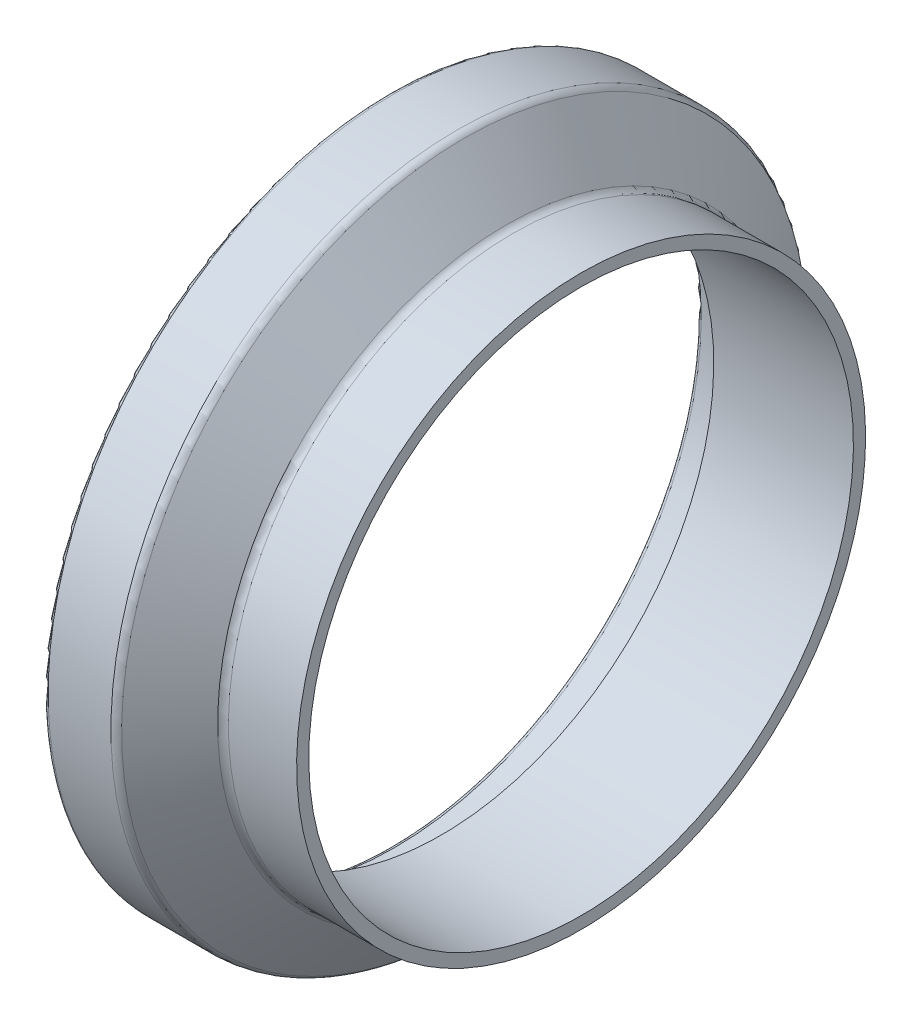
ISO-10303-21;
HEADER;
FILE_DESCRIPTION(('STEP AP214'),'2;1');
FILE_NAME('part.step','',(''),(''),'','','');
FILE_SCHEMA(('AUTOMOTIVE_DESIGN { 1 0 10303 214 1 1 1 1 }'));
ENDSEC;
DATA;
#1=APPLICATION_CONTEXT('core data for automotive mechanical design processes');
#2=APPLICATION_PROTOCOL_DEFINITION('international standard','automotive_design',2000,#1);
#3=PRODUCT_CONTEXT('',#1,'mechanical');
#4=PRODUCT('Part','Part','',(#3));
#5=PRODUCT_RELATED_PRODUCT_CATEGORY('part','',(#4));
#6=PRODUCT_DEFINITION_FORMATION('','',#4);
#7=PRODUCT_DEFINITION_CONTEXT('part definition',#1,'design');
#8=PRODUCT_DEFINITION('design','',#6,#7);
#9=PRODUCT_DEFINITION_SHAPE('','',#8);
#10=(LENGTH_UNIT() NAMED_UNIT(*) SI_UNIT(.MILLI.,.METRE.));
#11=(NAMED_UNIT(*) PLANE_ANGLE_UNIT() SI_UNIT($,.RADIAN.));
#12=(NAMED_UNIT(*) SI_UNIT($,.STERADIAN.) SOLID_ANGLE_UNIT());
#13=UNCERTAINTY_MEASURE_WITH_UNIT(LENGTH_MEASURE(1.E-05),#10,'distance_accuracy_value','');
#14=(GEOMETRIC_REPRESENTATION_CONTEXT(3) GLOBAL_UNCERTAINTY_ASSIGNED_CONTEXT((#13)) GLOBAL_UNIT_ASSIGNED_CONTEXT((#10,
#11,#12)) REPRESENTATION_CONTEXT('',''));
#15=CARTESIAN_POINT('',(0.,0.,0.));
#16=DIRECTION('',(0.,0.,1.));
#17=DIRECTION('',(1.,0.,0.));
#18=AXIS2_PLACEMENT_3D('',#15,#16,#17);
#19=CARTESIAN_POINT('',(-1.65198352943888,50.8,0.));
#20=DIRECTION('',(1.,0.,0.));
#21=DIRECTION('',(0.,0.999999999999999,0.));
#22=AXIS2_PLACEMENT_3D('',#19,#20,#21);
#23=PLANE('',#22);
#24=CARTESIAN_POINT('',(-1.65198352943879,0.,0.));
#25=DIRECTION('',(1.,0.,0.));
#26=DIRECTION('',(0.,0.999999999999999,0.));
#27=AXIS2_PLACEMENT_3D('',#24,#25,#26);
#28=CIRCLE('',#27,50.8);
#29=CARTESIAN_POINT('',(-1.65198352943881,50.7999999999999,0.));
#30=VERTEX_POINT('',#29);
#31=EDGE_CURVE('E86',#30,#30,#28,.T.);
#32=ORIENTED_EDGE('',*,*,#31,.T.);
#33=EDGE_LOOP('',(#32));
#34=FACE_BOUND('',#33,.T.);
#35=CARTESIAN_POINT('',(-1.65198352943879,0.,0.));
#36=DIRECTION('',(1.,0.,0.));
#37=DIRECTION('',(0.,0.999999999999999,0.));
#38=AXIS2_PLACEMENT_3D('',#35,#36,#37);
#39=CIRCLE('',#38,48.6283);
#40=CARTESIAN_POINT('',(-1.65198352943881,48.6283,0.));
#41=VERTEX_POINT('',#40);
#42=EDGE_CURVE('E12',#41,#41,#39,.T.);
#43=ORIENTED_EDGE('',*,*,#42,.F.);
#44=EDGE_LOOP('',(#43));
#45=FACE_BOUND('',#44,.T.);
#46=ADVANCED_FACE('F43',(#34,#45),#23,.T.);
#47=CARTESIAN_POINT('',(0.,0.,0.));
#48=DIRECTION('',(1.,0.,0.));
#49=DIRECTION('',(0.,0.999999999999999,0.));
#50=AXIS2_PLACEMENT_3D('',#47,#48,#49);
#51=CYLINDRICAL_SURFACE('',#50,48.6283);
#52=ORIENTED_EDGE('',*,*,#42,.T.);
#53=EDGE_LOOP('',(#52));
#54=FACE_BOUND('',#53,.T.);
#55=CARTESIAN_POINT('',(-26.5947835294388,0.,0.));
#56=DIRECTION('',(1.,0.,0.));
#57=DIRECTION('',(0.,0.999999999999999,0.));
#58=AXIS2_PLACEMENT_3D('',#55,#56,#57);
#59=CIRCLE('',#58,48.6283);
#60=CARTESIAN_POINT('',(-26.5947835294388,48.6283,0.));
#61=VERTEX_POINT('',#60);
#62=EDGE_CURVE('E49',#61,#61,#59,.T.);
#63=ORIENTED_EDGE('',*,*,#62,.F.);
#64=EDGE_LOOP('',(#63));
#65=FACE_BOUND('',#64,.T.);
#66=ADVANCED_FACE('F104',(#54,#65),#51,.F.);
#67=CARTESIAN_POINT('',(-26.5947835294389,48.6283,0.));
#68=DIRECTION('',(-1.,0.,0.));
#69=DIRECTION('',(0.,-0.999999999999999,0.));
#70=AXIS2_PLACEMENT_3D('',#67,#68,#69);
#71=PLANE('',#70);
#72=ORIENTED_EDGE('',*,*,#62,.T.);
#73=EDGE_LOOP('',(#72));
#74=FACE_BOUND('',#73,.T.);
#75=CARTESIAN_POINT('',(-26.5947835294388,0.,0.));
#76=DIRECTION('',(1.,0.,0.));
#77=DIRECTION('',(0.,0.999999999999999,0.));
#78=AXIS2_PLACEMENT_3D('',#75,#76,#77);
#79=CIRCLE('',#78,53.9623);
#80=CARTESIAN_POINT('',(-26.5947835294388,53.9622999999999,0.));
#81=VERTEX_POINT('',#80);
#82=EDGE_CURVE('E53',#81,#81,#79,.T.);
#83=ORIENTED_EDGE('',*,*,#82,.F.);
#84=EDGE_LOOP('',(#83));
#85=FACE_BOUND('',#84,.T.);
#86=ADVANCED_FACE('F108',(#74,#85),#71,.T.);
#87=CARTESIAN_POINT('',(-27.4075835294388,0.,0.));
#88=DIRECTION('',(1.,0.,0.));
#89=DIRECTION('',(0.,0.999999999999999,0.));
#90=AXIS2_PLACEMENT_3D('',#87,#88,#89);
#91=TOROIDAL_SURFACE('',#90,53.9623,0.812800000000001);
#92=ORIENTED_EDGE('',*,*,#82,.T.);
#93=EDGE_LOOP('',(#92));
#94=FACE_BOUND('',#93,.T.);
#95=CARTESIAN_POINT('',(-27.4075835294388,0.,0.));
#96=DIRECTION('',(1.,0.,0.));
#97=DIRECTION('',(0.,0.999999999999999,0.));
#98=AXIS2_PLACEMENT_3D('',#95,#96,#97);
#99=CIRCLE('',#98,54.7751);
#100=CARTESIAN_POINT('',(-27.4075835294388,54.7750999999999,0.));
#101=VERTEX_POINT('',#100);
#102=EDGE_CURVE('E57',#101,#101,#99,.T.);
#103=ORIENTED_EDGE('',*,*,#102,.F.);
#104=EDGE_LOOP('',(#103));
#105=FACE_BOUND('',#104,.T.);
#106=ADVANCED_FACE('F112',(#94,#105),#91,.F.);
#107=CARTESIAN_POINT('',(0.,0.,0.));
#108=DIRECTION('',(1.,0.,0.));
#109=DIRECTION('',(0.,0.999999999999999,0.));
#110=AXIS2_PLACEMENT_3D('',#107,#108,#109);
#111=CYLINDRICAL_SURFACE('',#110,54.7751);
#112=ORIENTED_EDGE('',*,*,#102,.T.);
#113=EDGE_LOOP('',(#112));
#114=FACE_BOUND('',#113,.T.);
#115=CARTESIAN_POINT('',(-34.9767835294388,0.,0.));
#116=DIRECTION('',(1.,0.,0.));
#117=DIRECTION('',(0.,0.999999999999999,0.));
#118=AXIS2_PLACEMENT_3D('',#115,#116,#117);
#119=CIRCLE('',#118,54.7751);
#120=CARTESIAN_POINT('',(-34.9767835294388,54.7750999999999,0.));
#121=VERTEX_POINT('',#120);
#122=EDGE_CURVE('E62',#121,#121,#119,.T.);
#123=ORIENTED_EDGE('',*,*,#122,.F.);
#124=EDGE_LOOP('',(#123));
#125=FACE_BOUND('',#124,.T.);
#126=ADVANCED_FACE('F118',(#114,#125),#111,.F.);
#127=CARTESIAN_POINT('',(-34.9767835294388,0.,0.));
#128=DIRECTION('',(1.,0.,0.));
#129=DIRECTION('',(0.,0.999999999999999,0.));
#130=AXIS2_PLACEMENT_3D('',#127,#128,#129);
#131=TOROIDAL_SURFACE('',#130,55.5879,0.812800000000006);
#132=ORIENTED_EDGE('',*,*,#122,.T.);
#133=EDGE_LOOP('',(#132));
#134=FACE_BOUND('',#133,.T.);
#135=CARTESIAN_POINT('',(-35.7895835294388,0.,0.));
#136=DIRECTION('',(1.,0.,0.));
#137=DIRECTION('',(0.,0.999999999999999,0.));
#138=AXIS2_PLACEMENT_3D('',#135,#136,#137);
#139=CIRCLE('',#138,55.5879);
#140=CARTESIAN_POINT('',(-35.7895835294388,55.5878999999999,0.));
#141=VERTEX_POINT('',#140);
#142=EDGE_CURVE('E65',#141,#141,#139,.T.);
#143=ORIENTED_EDGE('',*,*,#142,.F.);
#144=EDGE_LOOP('',(#143));
#145=FACE_BOUND('',#144,.T.);
#146=ADVANCED_FACE('F122',(#134,#145),#131,.T.);
#147=CARTESIAN_POINT('',(-35.7895835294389,55.5879,0.));
#148=DIRECTION('',(-1.,0.,0.));
#149=DIRECTION('',(0.,-0.999999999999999,0.));
#150=AXIS2_PLACEMENT_3D('',#147,#148,#149);
#151=PLANE('',#150);
#152=ORIENTED_EDGE('',*,*,#142,.T.);
#153=EDGE_LOOP('',(#152));
#154=FACE_BOUND('',#153,.T.);
#155=CARTESIAN_POINT('',(-35.7895835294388,0.,0.));
#156=DIRECTION('',(1.,0.,0.));
#157=DIRECTION('',(0.,0.999999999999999,0.));
#158=AXIS2_PLACEMENT_3D('',#155,#156,#157);
#159=CIRCLE('',#158,61.0362);
#160=CARTESIAN_POINT('',(-35.7895835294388,61.0362,0.));
#161=VERTEX_POINT('',#160);
#162=EDGE_CURVE('E68',#161,#161,#159,.T.);
#163=ORIENTED_EDGE('',*,*,#162,.F.);
#164=EDGE_LOOP('',(#163));
#165=FACE_BOUND('',#164,.T.);
#166=ADVANCED_FACE('F126',(#154,#165),#151,.T.);
#167=CARTESIAN_POINT('',(-34.9767835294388,0.,0.));
#168=DIRECTION('',(1.,0.,0.));
#169=DIRECTION('',(0.,0.999999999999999,0.));
#170=AXIS2_PLACEMENT_3D('',#167,#168,#169);
#171=TOROIDAL_SURFACE('',#170,61.0362,0.812800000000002);
#172=ORIENTED_EDGE('',*,*,#162,.T.);
#173=EDGE_LOOP('',(#172));
#174=FACE_BOUND('',#173,.T.);
#175=CARTESIAN_POINT('',(-34.9767835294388,0.,0.));
#176=DIRECTION('',(1.,0.,0.));
#177=DIRECTION('',(0.,0.999999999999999,0.));
#178=AXIS2_PLACEMENT_3D('',#175,#176,#177);
#179=CIRCLE('',#178,61.849);
#180=CARTESIAN_POINT('',(-34.9767835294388,61.849,0.));
#181=VERTEX_POINT('',#180);
#182=EDGE_CURVE('E71',#181,#181,#179,.T.);
#183=ORIENTED_EDGE('',*,*,#182,.F.);
#184=EDGE_LOOP('',(#183));
#185=FACE_BOUND('',#184,.T.);
#186=ADVANCED_FACE('F130',(#174,#185),#171,.T.);
#187=CARTESIAN_POINT('',(0.,0.,0.));
#188=DIRECTION('',(1.,0.,0.));
#189=DIRECTION('',(0.,0.999999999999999,0.));
#190=AXIS2_PLACEMENT_3D('',#187,#188,#189);
#191=CYLINDRICAL_SURFACE('',#190,61.849);
#192=ORIENTED_EDGE('',*,*,#182,.T.);
#193=EDGE_LOOP('',(#192));
#194=FACE_BOUND('',#193,.T.);
#195=CARTESIAN_POINT('',(-23.7604138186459,0.,0.));
#196=DIRECTION('',(1.,0.,0.));
#197=DIRECTION('',(0.,0.999999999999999,0.));
#198=AXIS2_PLACEMENT_3D('',#195,#196,#197);
#199=CIRCLE('',#198,61.849);
#200=CARTESIAN_POINT('',(-23.7604138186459,61.8489999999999,0.));
#201=VERTEX_POINT('',#200);
#202=EDGE_CURVE('E74',#201,#201,#199,.T.);
#203=ORIENTED_EDGE('',*,*,#202,.F.);
#204=EDGE_LOOP('',(#203));
#205=FACE_BOUND('',#204,.T.);
#206=ADVANCED_FACE('F134',(#194,#205),#191,.T.);
#207=CARTESIAN_POINT('',(-23.7604138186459,0.,0.));
#208=DIRECTION('',(1.,0.,0.));
#209=DIRECTION('',(0.,0.999999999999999,0.));
#210=AXIS2_PLACEMENT_3D('',#207,#208,#209);
#211=TOROIDAL_SURFACE('',#210,60.2488,1.6002);
#212=ORIENTED_EDGE('',*,*,#202,.T.);
#213=EDGE_LOOP('',(#212));
#214=FACE_BOUND('',#213,.T.);
#215=CARTESIAN_POINT('',(-22.4824372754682,0.,0.));
#216=DIRECTION('',(1.,0.,0.));
#217=DIRECTION('',(0.,0.999999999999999,0.));
#218=AXIS2_PLACEMENT_3D('',#215,#216,#217);
#219=CIRCLE('',#218,61.2118244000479);
#220=CARTESIAN_POINT('',(-22.4824372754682,61.2118244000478,0.));
#221=VERTEX_POINT('',#220);
#222=EDGE_CURVE('E77',#221,#221,#219,.T.);
#223=ORIENTED_EDGE('',*,*,#222,.F.);
#224=EDGE_LOOP('',(#223));
#225=FACE_BOUND('',#224,.T.);
#226=ADVANCED_FACE('F138',(#214,#225),#211,.T.);
#227=CARTESIAN_POINT('',(-15.1167110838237,0.,0.));
#228=DIRECTION('',(-1.,0.,0.));
#229=DIRECTION('',(0.,-0.999999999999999,0.));
#230=AXIS2_PLACEMENT_3D('',#227,#228,#229);
#231=CONICAL_SURFACE('',#230,51.4371755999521,0.925024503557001);
#232=ORIENTED_EDGE('',*,*,#222,.T.);
#233=EDGE_LOOP('',(#232));
#234=FACE_BOUND('',#233,.T.);
#235=CARTESIAN_POINT('',(-15.1167110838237,0.,0.));
#236=DIRECTION('',(1.,0.,0.));
#237=DIRECTION('',(0.,0.999999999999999,0.));
#238=AXIS2_PLACEMENT_3D('',#235,#236,#237);
#239=CIRCLE('',#238,51.4371755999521);
#240=CARTESIAN_POINT('',(-15.1167110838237,51.4371755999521,0.));
#241=VERTEX_POINT('',#240);
#242=EDGE_CURVE('E80',#241,#241,#239,.T.);
#243=ORIENTED_EDGE('',*,*,#242,.F.);
#244=EDGE_LOOP('',(#243));
#245=FACE_BOUND('',#244,.T.);
#246=ADVANCED_FACE('F100',(#234,#245),#231,.T.);
#247=CARTESIAN_POINT('',(-13.838734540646,0.,0.));
#248=DIRECTION('',(1.,0.,0.));
#249=DIRECTION('',(0.,0.999999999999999,0.));
#250=AXIS2_PLACEMENT_3D('',#247,#248,#249);
#251=TOROIDAL_SURFACE('',#250,52.4002,1.6002);
#252=ORIENTED_EDGE('',*,*,#242,.T.);
#253=EDGE_LOOP('',(#252));
#254=FACE_BOUND('',#253,.T.);
#255=CARTESIAN_POINT('',(-13.838734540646,0.,0.));
#256=DIRECTION('',(1.,0.,0.));
#257=DIRECTION('',(0.,0.999999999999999,0.));
#258=AXIS2_PLACEMENT_3D('',#255,#256,#257);
#259=CIRCLE('',#258,50.8);
#260=CARTESIAN_POINT('',(-13.838734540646,50.8,0.));
#261=VERTEX_POINT('',#260);
#262=EDGE_CURVE('E83',#261,#261,#259,.T.);
#263=ORIENTED_EDGE('',*,*,#262,.F.);
#264=EDGE_LOOP('',(#263));
#265=FACE_BOUND('',#264,.T.);
#266=ADVANCED_FACE('F94',(#254,#265),#251,.F.);
#267=CARTESIAN_POINT('',(0.,0.,0.));
#268=DIRECTION('',(1.,0.,0.));
#269=DIRECTION('',(0.,0.999999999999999,0.));
#270=AXIS2_PLACEMENT_3D('',#267,#268,#269);
#271=CYLINDRICAL_SURFACE('',#270,50.8);
#272=ORIENTED_EDGE('',*,*,#262,.T.);
#273=EDGE_LOOP('',(#272));
#274=FACE_BOUND('',#273,.T.);
#275=ORIENTED_EDGE('',*,*,#31,.F.);
#276=EDGE_LOOP('',(#275));
#277=FACE_BOUND('',#276,.T.);
#278=ADVANCED_FACE('F92',(#274,#277),#271,.T.);
#279=CLOSED_SHELL('',(#46,#66,#86,#106,#126,#146,#166,#186,#206,#226,#246,#266,#278));
#280=MANIFOLD_SOLID_BREP('B2',#279);
#281=ADVANCED_BREP_SHAPE_REPRESENTATION('',(#18,#280),#14);
#282=SHAPE_DEFINITION_REPRESENTATION(#9,#281);
ENDSEC;
END-ISO-10303-21;
